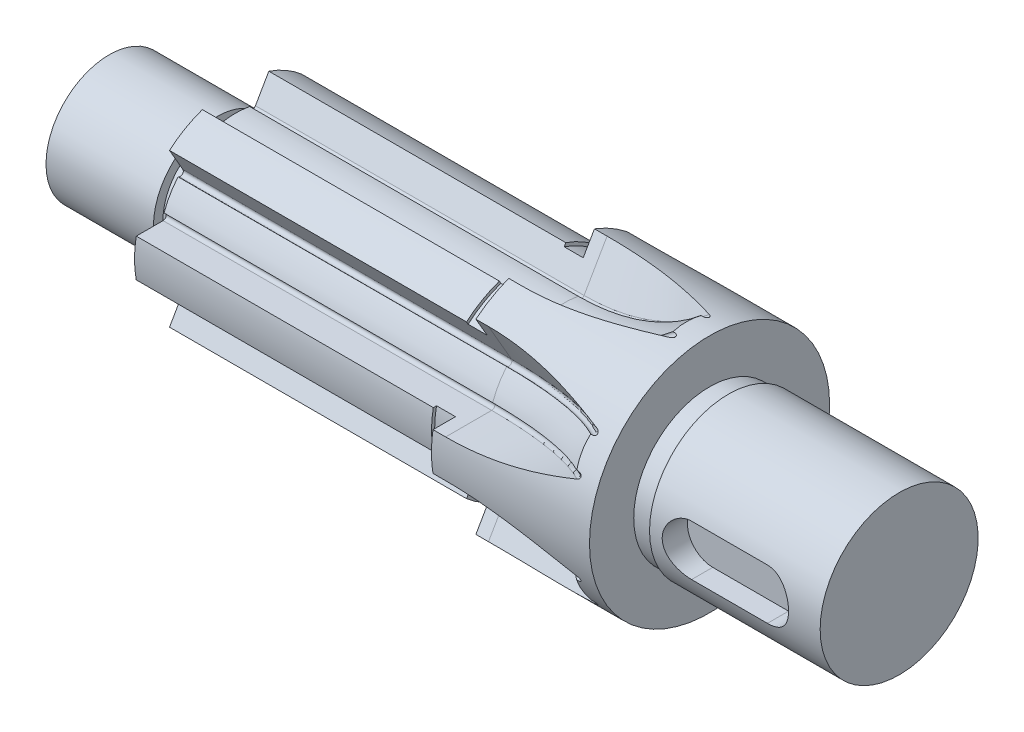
from build123d import *

# Parameters (mm, degrees)
CUT_EXTRUDE_1_DEPTH      = 4
PATTERN_CIRCULAR_1_COUNT = 6


with BuildPart() as part:
    # Sketch 1 → Revolve 1 (revolve)
    with BuildSketch(Plane.XY, mode=Mode.PRIVATE) as revolve_1_sk:
        Polygon((0, 0), (0, 10), (17, 10), (17, 8.5), (20, 8.5), (20, 16), (67, 16), (67, 15.5), (70, 15.5), (70, 19), (95, 19), (95, 12), (98, 12), (98, 12.5), (125, 12.5), (125, 0), align=None)
    revolve(revolve_1_sk.sketch.rotate(Axis((0, 0, 0), (1, 0, 0)), 90), axis=Axis((0, 0, 0), (1, 0, 0)))

    # Sketch 2 → Cut-Extrude 1 (cut)
    with BuildSketch(Plane.XY.offset(12.5)):
        with BuildLine():
            Line((104, 4), (116, 4))
            ThreePointArc((116, 4), (120, 0), (116, -4))
            Line((116, -4), (104, -4))
            ThreePointArc((104, -4), (100, 0), (104, 4))
        make_face()
    extrude(amount=-CUT_EXTRUDE_1_DEPTH, mode=Mode.SUBTRACT)

    # Sweep 1: sweep along a path in Sketch 7
    with BuildLine(Plane.XY) as sweep_1_path:
        Line((20, 12), (72, 12))
        ThreePointArc((72, 12), (91.123794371, 18.88549181), (101.469140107, 36.381300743))
    # Sketch 5 → Sweep 1 (sweep, cut)
    with BuildSketch(Plane.ZY.offset(-20)):
        with BuildLine():
            Line((-3.14104393, 11.440447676), (-8, 19.856406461))
            Line((-8, 19.856406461), (-8, 20.856406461))
            Line((-8, 20.856406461), (8, 20.856406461))
            Line((8, 20.856406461), (8, 19.856406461))
            Line((8, 19.856406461), (3.14104393, 11.440447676))
            ThreePointArc((3.14104393, 11.440447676), (2.529464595, 11.223420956), (2.21868424, 11.793109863))
            ThreePointArc((2.21868424, 11.793109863), (0, 12), (-2.21868424, 11.793109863))
            ThreePointArc((-2.21868424, 11.793109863), (-2.529464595, 11.223420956), (-3.14104393, 11.440447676))
        make_face()
    sweep_1 = sweep(path=sweep_1_path.line, mode=Mode.SUBTRACT)

    # Pattern Circular 1: Sweep 1 ×6 about axis
    pattern_circular_1_axis = Axis((0, 0, 0), (1, 0, 0))
    for i in range(1, PATTERN_CIRCULAR_1_COUNT):
        add(sweep_1.rotate(pattern_circular_1_axis, i * 360 / PATTERN_CIRCULAR_1_COUNT), mode=Mode.SUBTRACT)


solid = part.part
